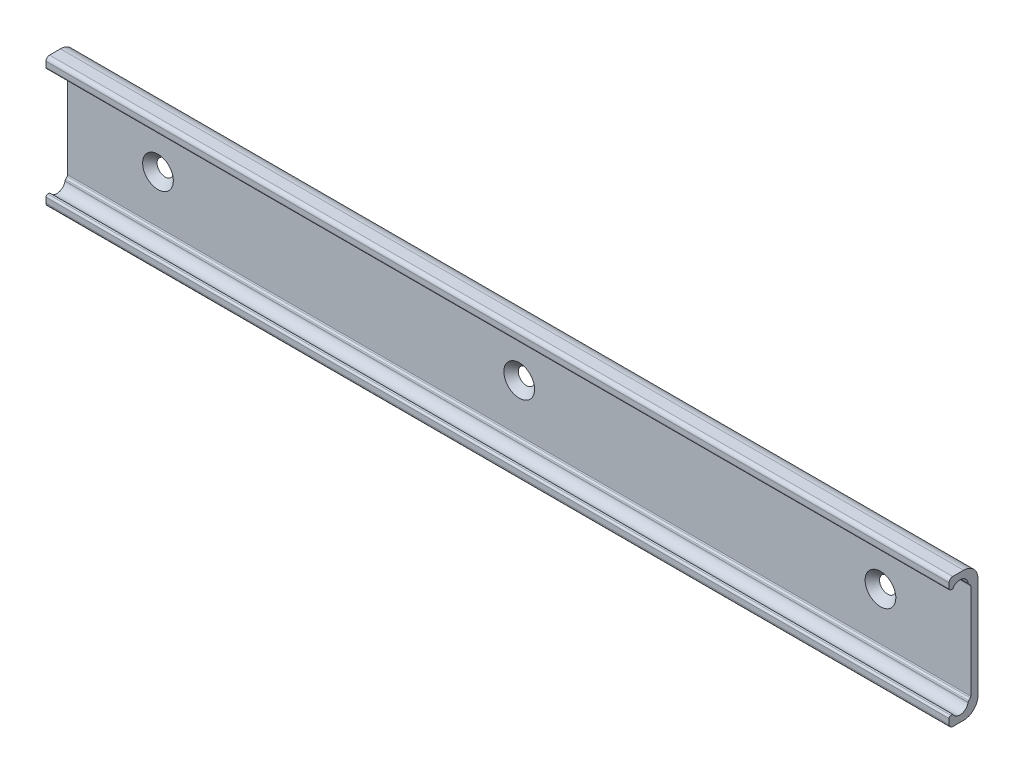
ISO-10303-21;
HEADER;
FILE_DESCRIPTION(('STEP AP214'),'2;1');
FILE_NAME('part.step','',(''),(''),'','','');
FILE_SCHEMA(('AUTOMOTIVE_DESIGN { 1 0 10303 214 1 1 1 1 }'));
ENDSEC;
DATA;
#1=APPLICATION_CONTEXT('core data for automotive mechanical design processes');
#2=APPLICATION_PROTOCOL_DEFINITION('international standard','automotive_design',2000,#1);
#3=PRODUCT_CONTEXT('',#1,'mechanical');
#4=PRODUCT('Part','Part','',(#3));
#5=PRODUCT_RELATED_PRODUCT_CATEGORY('part','',(#4));
#6=PRODUCT_DEFINITION_FORMATION('','',#4);
#7=PRODUCT_DEFINITION_CONTEXT('part definition',#1,'design');
#8=PRODUCT_DEFINITION('design','',#6,#7);
#9=PRODUCT_DEFINITION_SHAPE('','',#8);
#10=(LENGTH_UNIT() NAMED_UNIT(*) SI_UNIT(.MILLI.,.METRE.));
#11=(NAMED_UNIT(*) PLANE_ANGLE_UNIT() SI_UNIT($,.RADIAN.));
#12=(NAMED_UNIT(*) SI_UNIT($,.STERADIAN.) SOLID_ANGLE_UNIT());
#13=UNCERTAINTY_MEASURE_WITH_UNIT(LENGTH_MEASURE(1.E-05),#10,'distance_accuracy_value','');
#14=(GEOMETRIC_REPRESENTATION_CONTEXT(3) GLOBAL_UNCERTAINTY_ASSIGNED_CONTEXT((#13)) GLOBAL_UNIT_ASSIGNED_CONTEXT((#10,
#11,#12)) REPRESENTATION_CONTEXT('',''));
#15=CARTESIAN_POINT('',(0.,0.,0.));
#16=DIRECTION('',(0.,0.,1.));
#17=DIRECTION('',(1.,0.,0.));
#18=AXIS2_PLACEMENT_3D('',#15,#16,#17);
#19=CARTESIAN_POINT('',(225.,14.,4.));
#20=DIRECTION('',(-1.,0.,0.));
#21=DIRECTION('',(0.,0.,1.));
#22=AXIS2_PLACEMENT_3D('',#19,#20,#21);
#23=CYLINDRICAL_SURFACE('',#22,4.);
#24=CARTESIAN_POINT('',(-25.,14.,4.));
#25=DIRECTION('',(-1.,0.,0.));
#26=DIRECTION('',(0.,0.,1.));
#27=AXIS2_PLACEMENT_3D('',#24,#25,#26);
#28=CIRCLE('',#27,4.);
#29=CARTESIAN_POINT('',(-25.,18.,4.));
#30=VERTEX_POINT('',#29);
#31=CARTESIAN_POINT('',(-25.,14.,0.));
#32=VERTEX_POINT('',#31);
#33=EDGE_CURVE('E174',#30,#32,#28,.T.);
#34=ORIENTED_EDGE('',*,*,#33,.F.);
#35=DIRECTION('',(-1.,0.,0.));
#36=VECTOR('',#35,1.);
#37=CARTESIAN_POINT('',(225.,18.,4.));
#38=LINE('',#37,#36);
#39=CARTESIAN_POINT('',(225.,18.,4.));
#40=VERTEX_POINT('',#39);
#41=EDGE_CURVE('E9',#40,#30,#38,.T.);
#42=ORIENTED_EDGE('',*,*,#41,.F.);
#43=CARTESIAN_POINT('',(225.,14.,4.));
#44=DIRECTION('',(-1.,0.,0.));
#45=DIRECTION('',(0.,0.,1.));
#46=AXIS2_PLACEMENT_3D('',#43,#44,#45);
#47=CIRCLE('',#46,4.);
#48=CARTESIAN_POINT('',(225.,14.,0.));
#49=VERTEX_POINT('',#48);
#50=EDGE_CURVE('E176',#40,#49,#47,.T.);
#51=ORIENTED_EDGE('',*,*,#50,.T.);
#52=DIRECTION('',(-1.,0.,0.));
#53=VECTOR('',#52,1.);
#54=CARTESIAN_POINT('',(225.,14.,0.));
#55=LINE('',#54,#53);
#56=EDGE_CURVE('E17',#49,#32,#55,.T.);
#57=ORIENTED_EDGE('',*,*,#56,.T.);
#58=EDGE_LOOP('',(#34,#42,#51,#57));
#59=FACE_BOUND('',#58,.T.);
#60=ADVANCED_FACE('F14',(#59),#23,.T.);
#61=CARTESIAN_POINT('',(225.,18.,7.));
#62=DIRECTION('',(0.,1.,0.));
#63=DIRECTION('',(-1.,0.,0.));
#64=AXIS2_PLACEMENT_3D('',#61,#62,#63);
#65=PLANE('',#64);
#66=DIRECTION('',(0.,0.,-1.));
#67=VECTOR('',#66,1.);
#68=CARTESIAN_POINT('',(-25.,18.,7.));
#69=LINE('',#68,#67);
#70=CARTESIAN_POINT('',(-25.,18.,7.));
#71=VERTEX_POINT('',#70);
#72=EDGE_CURVE('E192',#71,#30,#69,.T.);
#73=ORIENTED_EDGE('',*,*,#72,.F.);
#74=DIRECTION('',(-1.,0.,0.));
#75=VECTOR('',#74,1.);
#76=CARTESIAN_POINT('',(225.,18.,7.));
#77=LINE('',#76,#75);
#78=CARTESIAN_POINT('',(225.,18.,7.));
#79=VERTEX_POINT('',#78);
#80=EDGE_CURVE('E22',#79,#71,#77,.T.);
#81=ORIENTED_EDGE('',*,*,#80,.F.);
#82=DIRECTION('',(0.,0.,-1.));
#83=VECTOR('',#82,1.);
#84=CARTESIAN_POINT('',(225.,18.,7.));
#85=LINE('',#84,#83);
#86=EDGE_CURVE('E181',#79,#40,#85,.T.);
#87=ORIENTED_EDGE('',*,*,#86,.T.);
#88=ORIENTED_EDGE('',*,*,#41,.T.);
#89=EDGE_LOOP('',(#73,#81,#87,#88));
#90=FACE_BOUND('',#89,.T.);
#91=ADVANCED_FACE('F448',(#90),#65,.T.);
#92=CARTESIAN_POINT('',(225.,17.,7.));
#93=DIRECTION('',(-1.,0.,0.));
#94=DIRECTION('',(0.,0.,1.));
#95=AXIS2_PLACEMENT_3D('',#92,#93,#94);
#96=CYLINDRICAL_SURFACE('',#95,1.);
#97=CARTESIAN_POINT('',(-25.,17.,7.));
#98=DIRECTION('',(-1.,0.,0.));
#99=DIRECTION('',(0.,0.,1.));
#100=AXIS2_PLACEMENT_3D('',#97,#98,#99);
#101=CIRCLE('',#100,1.);
#102=CARTESIAN_POINT('',(-25.,17.,8.));
#103=VERTEX_POINT('',#102);
#104=EDGE_CURVE('E258',#103,#71,#101,.T.);
#105=ORIENTED_EDGE('',*,*,#104,.F.);
#106=DIRECTION('',(-1.,0.,0.));
#107=VECTOR('',#106,1.);
#108=CARTESIAN_POINT('',(225.,17.,8.));
#109=LINE('',#108,#107);
#110=CARTESIAN_POINT('',(225.,17.,8.));
#111=VERTEX_POINT('',#110);
#112=EDGE_CURVE('E328',#111,#103,#109,.T.);
#113=ORIENTED_EDGE('',*,*,#112,.F.);
#114=CARTESIAN_POINT('',(225.,17.,7.));
#115=DIRECTION('',(-1.,0.,0.));
#116=DIRECTION('',(0.,0.,1.));
#117=AXIS2_PLACEMENT_3D('',#114,#115,#116);
#118=CIRCLE('',#117,1.);
#119=EDGE_CURVE('E324',#111,#79,#118,.T.);
#120=ORIENTED_EDGE('',*,*,#119,.T.);
#121=ORIENTED_EDGE('',*,*,#80,.T.);
#122=EDGE_LOOP('',(#105,#113,#120,#121));
#123=FACE_BOUND('',#122,.T.);
#124=ADVANCED_FACE('F453',(#123),#96,.T.);
#125=CARTESIAN_POINT('',(225.,15.55,8.));
#126=DIRECTION('',(0.,0.,1.));
#127=DIRECTION('',(1.,0.,0.));
#128=AXIS2_PLACEMENT_3D('',#125,#126,#127);
#129=PLANE('',#128);
#130=DIRECTION('',(0.,1.,0.));
#131=VECTOR('',#130,1.);
#132=CARTESIAN_POINT('',(-25.,15.55,8.));
#133=LINE('',#132,#131);
#134=CARTESIAN_POINT('',(-25.,15.55,8.));
#135=VERTEX_POINT('',#134);
#136=EDGE_CURVE('E255',#135,#103,#133,.T.);
#137=ORIENTED_EDGE('',*,*,#136,.F.);
#138=DIRECTION('',(-1.,0.,0.));
#139=VECTOR('',#138,1.);
#140=CARTESIAN_POINT('',(225.,15.55,8.));
#141=LINE('',#140,#139);
#142=CARTESIAN_POINT('',(225.,15.55,8.));
#143=VERTEX_POINT('',#142);
#144=EDGE_CURVE('E330',#143,#135,#141,.T.);
#145=ORIENTED_EDGE('',*,*,#144,.F.);
#146=DIRECTION('',(0.,1.,0.));
#147=VECTOR('',#146,1.);
#148=CARTESIAN_POINT('',(225.,15.55,8.));
#149=LINE('',#148,#147);
#150=EDGE_CURVE('E321',#143,#111,#149,.T.);
#151=ORIENTED_EDGE('',*,*,#150,.T.);
#152=ORIENTED_EDGE('',*,*,#112,.T.);
#153=EDGE_LOOP('',(#137,#145,#151,#152));
#154=FACE_BOUND('',#153,.T.);
#155=ADVANCED_FACE('F445',(#154),#129,.T.);
#156=CARTESIAN_POINT('',(225.,15.5499998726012,7.5));
#157=DIRECTION('',(-1.,0.,0.));
#158=DIRECTION('',(0.,0.,1.));
#159=AXIS2_PLACEMENT_3D('',#156,#157,#158);
#160=CYLINDRICAL_SURFACE('',#159,0.500000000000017);
#161=CARTESIAN_POINT('',(-25.,15.5499998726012,7.5));
#162=DIRECTION('',(-1.,0.,0.));
#163=DIRECTION('',(0.,0.,1.));
#164=AXIS2_PLACEMENT_3D('',#161,#162,#163);
#165=CIRCLE('',#164,0.500000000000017);
#166=CARTESIAN_POINT('',(-25.,15.0499998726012,7.49999995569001));
#167=VERTEX_POINT('',#166);
#168=EDGE_CURVE('E252',#167,#135,#165,.T.);
#169=ORIENTED_EDGE('',*,*,#168,.F.);
#170=DIRECTION('',(-1.,0.,0.));
#171=VECTOR('',#170,1.);
#172=CARTESIAN_POINT('',(225.,15.0499998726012,7.49999995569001));
#173=LINE('',#172,#171);
#174=CARTESIAN_POINT('',(225.,15.0499998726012,7.49999995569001));
#175=VERTEX_POINT('',#174);
#176=EDGE_CURVE('E332',#175,#167,#173,.T.);
#177=ORIENTED_EDGE('',*,*,#176,.F.);
#178=CARTESIAN_POINT('',(225.,15.5499998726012,7.5));
#179=DIRECTION('',(-1.,0.,0.));
#180=DIRECTION('',(0.,0.,1.));
#181=AXIS2_PLACEMENT_3D('',#178,#179,#180);
#182=CIRCLE('',#181,0.500000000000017);
#183=EDGE_CURVE('E318',#175,#143,#182,.T.);
#184=ORIENTED_EDGE('',*,*,#183,.T.);
#185=ORIENTED_EDGE('',*,*,#144,.T.);
#186=EDGE_LOOP('',(#169,#177,#184,#185));
#187=FACE_BOUND('',#186,.T.);
#188=ADVANCED_FACE('F441',(#187),#160,.T.);
#189=CARTESIAN_POINT('',(225.,15.0499998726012,7.49999995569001));
#190=DIRECTION('',(0.,-1.,0.));
#191=DIRECTION('',(1.,0.,0.));
#192=AXIS2_PLACEMENT_3D('',#189,#190,#191);
#193=PLANE('',#192);
#194=DIRECTION('',(0.,0.,1.));
#195=VECTOR('',#194,1.);
#196=CARTESIAN_POINT('',(-25.,15.0499998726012,7.49999995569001));
#197=LINE('',#196,#195);
#198=CARTESIAN_POINT('',(-25.,15.0499998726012,6.99185845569));
#199=VERTEX_POINT('',#198);
#200=EDGE_CURVE('E249',#199,#167,#197,.T.);
#201=ORIENTED_EDGE('',*,*,#200,.F.);
#202=DIRECTION('',(-1.,0.,0.));
#203=VECTOR('',#202,1.);
#204=CARTESIAN_POINT('',(225.,15.0499998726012,6.99185845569));
#205=LINE('',#204,#203);
#206=CARTESIAN_POINT('',(225.,15.0499998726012,6.99185845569));
#207=VERTEX_POINT('',#206);
#208=EDGE_CURVE('E334',#207,#199,#205,.T.);
#209=ORIENTED_EDGE('',*,*,#208,.F.);
#210=DIRECTION('',(0.,0.,1.));
#211=VECTOR('',#210,1.);
#212=CARTESIAN_POINT('',(225.,15.0499998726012,7.49999995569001));
#213=LINE('',#212,#211);
#214=EDGE_CURVE('E315',#207,#175,#213,.T.);
#215=ORIENTED_EDGE('',*,*,#214,.T.);
#216=ORIENTED_EDGE('',*,*,#176,.T.);
#217=EDGE_LOOP('',(#201,#209,#215,#216));
#218=FACE_BOUND('',#217,.T.);
#219=ADVANCED_FACE('F437',(#218),#193,.T.);
#220=CARTESIAN_POINT('',(225.,13.899999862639,4.99999993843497));
#221=DIRECTION('',(-1.,0.,0.));
#222=DIRECTION('',(0.,0.,1.));
#223=AXIS2_PLACEMENT_3D('',#220,#221,#222);
#224=CYLINDRICAL_SURFACE('',#223,2.30000008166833);
#225=CARTESIAN_POINT('',(-25.,13.899999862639,4.99999993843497));
#226=DIRECTION('',(1.,0.,0.));
#227=DIRECTION('',(0.,0.,1.));
#228=AXIS2_PLACEMENT_3D('',#225,#226,#227);
#229=CIRCLE('',#228,2.30000008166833);
#230=CARTESIAN_POINT('',(-25.,14.3822673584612,2.75112945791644));
#231=VERTEX_POINT('',#230);
#232=EDGE_CURVE('E246',#231,#199,#229,.T.);
#233=ORIENTED_EDGE('',*,*,#232,.F.);
#234=DIRECTION('',(-1.,0.,0.));
#235=VECTOR('',#234,1.);
#236=CARTESIAN_POINT('',(225.,14.3822673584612,2.75112945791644));
#237=LINE('',#236,#235);
#238=CARTESIAN_POINT('',(225.,14.3822673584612,2.75112945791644));
#239=VERTEX_POINT('',#238);
#240=EDGE_CURVE('E336',#239,#231,#237,.T.);
#241=ORIENTED_EDGE('',*,*,#240,.F.);
#242=CARTESIAN_POINT('',(225.,13.899999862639,4.99999993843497));
#243=DIRECTION('',(1.,0.,0.));
#244=DIRECTION('',(0.,0.,1.));
#245=AXIS2_PLACEMENT_3D('',#242,#243,#244);
#246=CIRCLE('',#245,2.30000008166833);
#247=EDGE_CURVE('E312',#239,#207,#246,.T.);
#248=ORIENTED_EDGE('',*,*,#247,.T.);
#249=ORIENTED_EDGE('',*,*,#208,.T.);
#250=EDGE_LOOP('',(#233,#241,#248,#249));
#251=FACE_BOUND('',#250,.T.);
#252=ADVANCED_FACE('F433',(#251),#224,.F.);
#253=CARTESIAN_POINT('',(225.,14.2647621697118,2.72240648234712));
#254=DIRECTION('',(0.,-0.237449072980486,0.971399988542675));
#255=DIRECTION('',(0.,0.971399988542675,0.237449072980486));
#256=AXIS2_PLACEMENT_3D('',#253,#254,#255);
#257=PLANE('',#256);
#258=DIRECTION('',(0.,0.971399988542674,0.237449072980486));
#259=VECTOR('',#258,1.);
#260=CARTESIAN_POINT('',(-25.,14.2647621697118,2.72240648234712));
#261=LINE('',#260,#259);
#262=CARTESIAN_POINT('',(-25.,14.2647621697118,2.72240648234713));
#263=VERTEX_POINT('',#262);
#264=EDGE_CURVE('E243',#263,#231,#261,.T.);
#265=ORIENTED_EDGE('',*,*,#264,.F.);
#266=DIRECTION('',(-1.,0.,0.));
#267=VECTOR('',#266,1.);
#268=CARTESIAN_POINT('',(225.,14.2647621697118,2.72240648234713));
#269=LINE('',#268,#267);
#270=CARTESIAN_POINT('',(225.,14.2647621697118,2.72240648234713));
#271=VERTEX_POINT('',#270);
#272=EDGE_CURVE('E338',#271,#263,#269,.T.);
#273=ORIENTED_EDGE('',*,*,#272,.F.);
#274=DIRECTION('',(0.,0.971399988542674,0.237449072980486));
#275=VECTOR('',#274,1.);
#276=CARTESIAN_POINT('',(225.,14.2647621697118,2.72240648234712));
#277=LINE('',#276,#275);
#278=EDGE_CURVE('E309',#271,#239,#277,.T.);
#279=ORIENTED_EDGE('',*,*,#278,.T.);
#280=ORIENTED_EDGE('',*,*,#240,.T.);
#281=EDGE_LOOP('',(#265,#273,#279,#280));
#282=FACE_BOUND('',#281,.T.);
#283=ADVANCED_FACE('F429',(#282),#257,.T.);
#284=CARTESIAN_POINT('',(225.,14.3343843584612,2.2272774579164));
#285=DIRECTION('',(-1.,0.,0.));
#286=DIRECTION('',(0.,0.,1.));
#287=AXIS2_PLACEMENT_3D('',#284,#285,#286);
#288=CYLINDRICAL_SURFACE('',#287,0.49999999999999);
#289=CARTESIAN_POINT('',(-25.,14.3343843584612,2.2272774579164));
#290=DIRECTION('',(-1.,0.,0.));
#291=DIRECTION('',(0.,0.,1.));
#292=AXIS2_PLACEMENT_3D('',#289,#290,#291);
#293=CIRCLE('',#292,0.49999999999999);
#294=CARTESIAN_POINT('',(-25.,13.980830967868,2.58083084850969));
#295=VERTEX_POINT('',#294);
#296=EDGE_CURVE('E240',#295,#263,#293,.T.);
#297=ORIENTED_EDGE('',*,*,#296,.F.);
#298=DIRECTION('',(-1.,0.,0.));
#299=VECTOR('',#298,1.);
#300=CARTESIAN_POINT('',(225.,13.980830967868,2.58083084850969));
#301=LINE('',#300,#299);
#302=CARTESIAN_POINT('',(225.,13.980830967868,2.58083084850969));
#303=VERTEX_POINT('',#302);
#304=EDGE_CURVE('E340',#303,#295,#301,.T.);
#305=ORIENTED_EDGE('',*,*,#304,.F.);
#306=CARTESIAN_POINT('',(225.,14.3343843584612,2.2272774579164));
#307=DIRECTION('',(-1.,0.,0.));
#308=DIRECTION('',(0.,0.,1.));
#309=AXIS2_PLACEMENT_3D('',#306,#307,#308);
#310=CIRCLE('',#309,0.49999999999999);
#311=EDGE_CURVE('E306',#303,#271,#310,.T.);
#312=ORIENTED_EDGE('',*,*,#311,.T.);
#313=ORIENTED_EDGE('',*,*,#272,.T.);
#314=EDGE_LOOP('',(#297,#305,#312,#313));
#315=FACE_BOUND('',#314,.T.);
#316=ADVANCED_FACE('F425',(#315),#288,.T.);
#317=CARTESIAN_POINT('',(225.,13.5464468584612,2.1464464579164));
#318=DIRECTION('',(0.,-0.707107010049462,0.707106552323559));
#319=DIRECTION('',(0.,0.707106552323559,0.707107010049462));
#320=AXIS2_PLACEMENT_3D('',#317,#318,#319);
#321=PLANE('',#320);
#322=DIRECTION('',(0.,0.707106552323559,0.707107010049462));
#323=VECTOR('',#322,1.);
#324=CARTESIAN_POINT('',(-25.,13.5464468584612,2.1464464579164));
#325=LINE('',#324,#323);
#326=CARTESIAN_POINT('',(-25.,13.5464468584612,2.1464464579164));
#327=VERTEX_POINT('',#326);
#328=EDGE_CURVE('E237',#327,#295,#325,.T.);
#329=ORIENTED_EDGE('',*,*,#328,.F.);
#330=DIRECTION('',(-1.,0.,0.));
#331=VECTOR('',#330,1.);
#332=CARTESIAN_POINT('',(225.,13.5464468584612,2.1464464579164));
#333=LINE('',#332,#331);
#334=CARTESIAN_POINT('',(225.,13.5464468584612,2.1464464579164));
#335=VERTEX_POINT('',#334);
#336=EDGE_CURVE('E342',#335,#327,#333,.T.);
#337=ORIENTED_EDGE('',*,*,#336,.F.);
#338=DIRECTION('',(0.,0.707106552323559,0.707107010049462));
#339=VECTOR('',#338,1.);
#340=CARTESIAN_POINT('',(225.,13.5464468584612,2.1464464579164));
#341=LINE('',#340,#339);
#342=EDGE_CURVE('E303',#335,#303,#341,.T.);
#343=ORIENTED_EDGE('',*,*,#342,.T.);
#344=ORIENTED_EDGE('',*,*,#304,.T.);
#345=EDGE_LOOP('',(#329,#337,#343,#344));
#346=FACE_BOUND('',#345,.T.);
#347=ADVANCED_FACE('F421',(#346),#321,.T.);
#348=CARTESIAN_POINT('',(225.,13.1928934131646,2.49999990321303));
#349=DIRECTION('',(-1.,0.,0.));
#350=DIRECTION('',(0.,0.,1.));
#351=AXIS2_PLACEMENT_3D('',#348,#349,#350);
#352=CYLINDRICAL_SURFACE('',#351,0.500000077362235);
#353=CARTESIAN_POINT('',(-25.,13.1928934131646,2.49999990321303));
#354=DIRECTION('',(1.,0.,0.));
#355=DIRECTION('',(0.,0.,1.));
#356=AXIS2_PLACEMENT_3D('',#353,#354,#355);
#357=CIRCLE('',#356,0.500000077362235);
#358=CARTESIAN_POINT('',(-25.,13.1928934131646,1.9999998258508));
#359=VERTEX_POINT('',#358);
#360=EDGE_CURVE('E234',#359,#327,#357,.T.);
#361=ORIENTED_EDGE('',*,*,#360,.F.);
#362=DIRECTION('',(-1.,0.,0.));
#363=VECTOR('',#362,1.);
#364=CARTESIAN_POINT('',(225.,13.1928934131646,1.9999998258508));
#365=LINE('',#364,#363);
#366=CARTESIAN_POINT('',(225.,13.1928934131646,1.9999998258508));
#367=VERTEX_POINT('',#366);
#368=EDGE_CURVE('E344',#367,#359,#365,.T.);
#369=ORIENTED_EDGE('',*,*,#368,.F.);
#370=CARTESIAN_POINT('',(225.,13.1928934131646,2.49999990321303));
#371=DIRECTION('',(1.,0.,0.));
#372=DIRECTION('',(0.,0.,1.));
#373=AXIS2_PLACEMENT_3D('',#370,#371,#372);
#374=CIRCLE('',#373,0.500000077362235);
#375=EDGE_CURVE('E300',#367,#335,#374,.T.);
#376=ORIENTED_EDGE('',*,*,#375,.T.);
#377=ORIENTED_EDGE('',*,*,#336,.T.);
#378=EDGE_LOOP('',(#361,#369,#376,#377));
#379=FACE_BOUND('',#378,.T.);
#380=ADVANCED_FACE('F417',(#379),#352,.F.);
#381=CARTESIAN_POINT('',(225.,-13.1928934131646,1.9999998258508));
#382=DIRECTION('',(0.,0.,1.));
#383=DIRECTION('',(0.,1.,0.));
#384=AXIS2_PLACEMENT_3D('',#381,#382,#383);
#385=PLANE('',#384);
#386=CARTESIAN_POINT('',(200.,0.,1.9999998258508));
#387=DIRECTION('',(0.,0.,1.));
#388=DIRECTION('',(0.,1.,0.));
#389=AXIS2_PLACEMENT_3D('',#386,#387,#388);
#390=CIRCLE('',#389,4.25);
#391=CARTESIAN_POINT('',(200.,4.25,1.99999982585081));
#392=VERTEX_POINT('',#391);
#393=EDGE_CURVE('E702',#392,#392,#390,.T.);
#394=ORIENTED_EDGE('',*,*,#393,.F.);
#395=EDGE_LOOP('',(#394));
#396=FACE_BOUND('',#395,.T.);
#397=CARTESIAN_POINT('',(100.,0.,1.9999998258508));
#398=DIRECTION('',(0.,0.,1.));
#399=DIRECTION('',(0.,1.,0.));
#400=AXIS2_PLACEMENT_3D('',#397,#398,#399);
#401=CIRCLE('',#400,4.25);
#402=CARTESIAN_POINT('',(100.,4.25,1.99999982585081));
#403=VERTEX_POINT('',#402);
#404=EDGE_CURVE('E706',#403,#403,#401,.T.);
#405=ORIENTED_EDGE('',*,*,#404,.F.);
#406=EDGE_LOOP('',(#405));
#407=FACE_BOUND('',#406,.T.);
#408=CARTESIAN_POINT('',(0.,0.,1.9999998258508));
#409=DIRECTION('',(0.,0.,1.));
#410=DIRECTION('',(0.,1.,0.));
#411=AXIS2_PLACEMENT_3D('',#408,#409,#410);
#412=CIRCLE('',#411,4.25);
#413=CARTESIAN_POINT('',(0.,4.25,1.99999982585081));
#414=VERTEX_POINT('',#413);
#415=EDGE_CURVE('E196',#414,#414,#412,.T.);
#416=ORIENTED_EDGE('',*,*,#415,.F.);
#417=EDGE_LOOP('',(#416));
#418=FACE_BOUND('',#417,.T.);
#419=DIRECTION('',(0.,1.,0.));
#420=VECTOR('',#419,1.);
#421=CARTESIAN_POINT('',(-25.,-13.1928934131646,1.9999998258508));
#422=LINE('',#421,#420);
#423=CARTESIAN_POINT('',(-25.,-13.1928934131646,1.9999998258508));
#424=VERTEX_POINT('',#423);
#425=EDGE_CURVE('E231',#424,#359,#422,.T.);
#426=ORIENTED_EDGE('',*,*,#425,.F.);
#427=DIRECTION('',(-1.,0.,0.));
#428=VECTOR('',#427,1.);
#429=CARTESIAN_POINT('',(225.,-13.1928934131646,1.9999998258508));
#430=LINE('',#429,#428);
#431=CARTESIAN_POINT('',(225.,-13.1928934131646,1.9999998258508));
#432=VERTEX_POINT('',#431);
#433=EDGE_CURVE('E346',#432,#424,#430,.T.);
#434=ORIENTED_EDGE('',*,*,#433,.F.);
#435=DIRECTION('',(0.,1.,0.));
#436=VECTOR('',#435,1.);
#437=CARTESIAN_POINT('',(225.,-13.1928934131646,1.9999998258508));
#438=LINE('',#437,#436);
#439=EDGE_CURVE('E297',#432,#367,#438,.T.);
#440=ORIENTED_EDGE('',*,*,#439,.T.);
#441=ORIENTED_EDGE('',*,*,#368,.T.);
#442=EDGE_LOOP('',(#426,#434,#440,#441));
#443=FACE_BOUND('',#442,.T.);
#444=ADVANCED_FACE('F413',(#396,#407,#418,#443),#385,.T.);
#445=CARTESIAN_POINT('',(225.,-13.1928934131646,2.49999990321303));
#446=DIRECTION('',(-1.,0.,0.));
#447=DIRECTION('',(0.,0.,1.));
#448=AXIS2_PLACEMENT_3D('',#445,#446,#447);
#449=CYLINDRICAL_SURFACE('',#448,0.500000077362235);
#450=CARTESIAN_POINT('',(-25.,-13.1928934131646,2.49999990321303));
#451=DIRECTION('',(1.,0.,0.));
#452=DIRECTION('',(0.,0.,-1.));
#453=AXIS2_PLACEMENT_3D('',#450,#451,#452);
#454=CIRCLE('',#453,0.500000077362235);
#455=CARTESIAN_POINT('',(-25.,-13.5464468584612,2.1464464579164));
#456=VERTEX_POINT('',#455);
#457=EDGE_CURVE('E228',#456,#424,#454,.T.);
#458=ORIENTED_EDGE('',*,*,#457,.F.);
#459=DIRECTION('',(-1.,0.,0.));
#460=VECTOR('',#459,1.);
#461=CARTESIAN_POINT('',(225.,-13.5464468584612,2.1464464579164));
#462=LINE('',#461,#460);
#463=CARTESIAN_POINT('',(225.,-13.5464468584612,2.1464464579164));
#464=VERTEX_POINT('',#463);
#465=EDGE_CURVE('E348',#464,#456,#462,.T.);
#466=ORIENTED_EDGE('',*,*,#465,.F.);
#467=CARTESIAN_POINT('',(225.,-13.1928934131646,2.49999990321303));
#468=DIRECTION('',(1.,0.,0.));
#469=DIRECTION('',(0.,0.,-1.));
#470=AXIS2_PLACEMENT_3D('',#467,#468,#469);
#471=CIRCLE('',#470,0.500000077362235);
#472=EDGE_CURVE('E294',#464,#432,#471,.T.);
#473=ORIENTED_EDGE('',*,*,#472,.T.);
#474=ORIENTED_EDGE('',*,*,#433,.T.);
#475=EDGE_LOOP('',(#458,#466,#473,#474));
#476=FACE_BOUND('',#475,.T.);
#477=ADVANCED_FACE('F409',(#476),#449,.F.);
#478=CARTESIAN_POINT('',(225.,-13.5464468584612,2.1464464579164));
#479=DIRECTION('',(0.,0.707107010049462,0.707106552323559));
#480=DIRECTION('',(0.,0.707106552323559,-0.707107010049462));
#481=AXIS2_PLACEMENT_3D('',#478,#479,#480);
#482=PLANE('',#481);
#483=DIRECTION('',(0.,0.707106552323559,-0.707107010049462));
#484=VECTOR('',#483,1.);
#485=CARTESIAN_POINT('',(-25.,-13.5464468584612,2.1464464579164));
#486=LINE('',#485,#484);
#487=CARTESIAN_POINT('',(-25.,-13.980830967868,2.58083084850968));
#488=VERTEX_POINT('',#487);
#489=EDGE_CURVE('E225',#488,#456,#486,.T.);
#490=ORIENTED_EDGE('',*,*,#489,.F.);
#491=DIRECTION('',(-1.,0.,0.));
#492=VECTOR('',#491,1.);
#493=CARTESIAN_POINT('',(225.,-13.980830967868,2.58083084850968));
#494=LINE('',#493,#492);
#495=CARTESIAN_POINT('',(225.,-13.980830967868,2.58083084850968));
#496=VERTEX_POINT('',#495);
#497=EDGE_CURVE('E350',#496,#488,#494,.T.);
#498=ORIENTED_EDGE('',*,*,#497,.F.);
#499=DIRECTION('',(0.,0.707106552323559,-0.707107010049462));
#500=VECTOR('',#499,1.);
#501=CARTESIAN_POINT('',(225.,-13.5464468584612,2.1464464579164));
#502=LINE('',#501,#500);
#503=EDGE_CURVE('E291',#496,#464,#502,.T.);
#504=ORIENTED_EDGE('',*,*,#503,.T.);
#505=ORIENTED_EDGE('',*,*,#465,.T.);
#506=EDGE_LOOP('',(#490,#498,#504,#505));
#507=FACE_BOUND('',#506,.T.);
#508=ADVANCED_FACE('F405',(#507),#482,.T.);
#509=CARTESIAN_POINT('',(225.,-14.3343843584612,2.22727745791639));
#510=DIRECTION('',(-1.,0.,0.));
#511=DIRECTION('',(0.,0.,1.));
#512=AXIS2_PLACEMENT_3D('',#509,#510,#511);
#513=CYLINDRICAL_SURFACE('',#512,0.49999999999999);
#514=CARTESIAN_POINT('',(-25.,-14.3343843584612,2.22727745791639));
#515=DIRECTION('',(-1.,0.,0.));
#516=DIRECTION('',(0.,0.,-1.));
#517=AXIS2_PLACEMENT_3D('',#514,#515,#516);
#518=CIRCLE('',#517,0.49999999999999);
#519=CARTESIAN_POINT('',(-25.,-14.2647621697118,2.72240648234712));
#520=VERTEX_POINT('',#519);
#521=EDGE_CURVE('E222',#520,#488,#518,.T.);
#522=ORIENTED_EDGE('',*,*,#521,.F.);
#523=DIRECTION('',(-1.,0.,0.));
#524=VECTOR('',#523,1.);
#525=CARTESIAN_POINT('',(225.,-14.2647621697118,2.72240648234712));
#526=LINE('',#525,#524);
#527=CARTESIAN_POINT('',(225.,-14.2647621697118,2.72240648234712));
#528=VERTEX_POINT('',#527);
#529=EDGE_CURVE('E352',#528,#520,#526,.T.);
#530=ORIENTED_EDGE('',*,*,#529,.F.);
#531=CARTESIAN_POINT('',(225.,-14.3343843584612,2.22727745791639));
#532=DIRECTION('',(-1.,0.,0.));
#533=DIRECTION('',(0.,0.,-1.));
#534=AXIS2_PLACEMENT_3D('',#531,#532,#533);
#535=CIRCLE('',#534,0.49999999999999);
#536=EDGE_CURVE('E288',#528,#496,#535,.T.);
#537=ORIENTED_EDGE('',*,*,#536,.T.);
#538=ORIENTED_EDGE('',*,*,#497,.T.);
#539=EDGE_LOOP('',(#522,#530,#537,#538));
#540=FACE_BOUND('',#539,.T.);
#541=ADVANCED_FACE('F401',(#540),#513,.T.);
#542=CARTESIAN_POINT('',(225.,-14.2647621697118,2.72240648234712));
#543=DIRECTION('',(0.,0.237449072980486,0.971399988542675));
#544=DIRECTION('',(0.,0.971399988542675,-0.237449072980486));
#545=AXIS2_PLACEMENT_3D('',#542,#543,#544);
#546=PLANE('',#545);
#547=DIRECTION('',(0.,0.971399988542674,-0.237449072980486));
#548=VECTOR('',#547,1.);
#549=CARTESIAN_POINT('',(-25.,-14.2647621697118,2.72240648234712));
#550=LINE('',#549,#548);
#551=CARTESIAN_POINT('',(-25.,-14.3822673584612,2.75112945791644));
#552=VERTEX_POINT('',#551);
#553=EDGE_CURVE('E219',#552,#520,#550,.T.);
#554=ORIENTED_EDGE('',*,*,#553,.F.);
#555=DIRECTION('',(-1.,0.,0.));
#556=VECTOR('',#555,1.);
#557=CARTESIAN_POINT('',(225.,-14.3822673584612,2.75112945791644));
#558=LINE('',#557,#556);
#559=CARTESIAN_POINT('',(225.,-14.3822673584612,2.75112945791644));
#560=VERTEX_POINT('',#559);
#561=EDGE_CURVE('E354',#560,#552,#558,.T.);
#562=ORIENTED_EDGE('',*,*,#561,.F.);
#563=DIRECTION('',(0.,0.971399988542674,-0.237449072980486));
#564=VECTOR('',#563,1.);
#565=CARTESIAN_POINT('',(225.,-14.2647621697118,2.72240648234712));
#566=LINE('',#565,#564);
#567=EDGE_CURVE('E285',#560,#528,#566,.T.);
#568=ORIENTED_EDGE('',*,*,#567,.T.);
#569=ORIENTED_EDGE('',*,*,#529,.T.);
#570=EDGE_LOOP('',(#554,#562,#568,#569));
#571=FACE_BOUND('',#570,.T.);
#572=ADVANCED_FACE('F397',(#571),#546,.T.);
#573=CARTESIAN_POINT('',(225.,-13.899999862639,4.99999993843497));
#574=DIRECTION('',(-1.,0.,0.));
#575=DIRECTION('',(0.,0.,1.));
#576=AXIS2_PLACEMENT_3D('',#573,#574,#575);
#577=CYLINDRICAL_SURFACE('',#576,2.30000008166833);
#578=CARTESIAN_POINT('',(-25.,-13.899999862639,4.99999993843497));
#579=DIRECTION('',(1.,0.,0.));
#580=DIRECTION('',(0.,0.,-1.));
#581=AXIS2_PLACEMENT_3D('',#578,#579,#580);
#582=CIRCLE('',#581,2.30000008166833);
#583=CARTESIAN_POINT('',(-25.,-15.0499998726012,6.99185845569));
#584=VERTEX_POINT('',#583);
#585=EDGE_CURVE('E216',#584,#552,#582,.T.);
#586=ORIENTED_EDGE('',*,*,#585,.F.);
#587=DIRECTION('',(-1.,0.,0.));
#588=VECTOR('',#587,1.);
#589=CARTESIAN_POINT('',(225.,-15.0499998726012,6.99185845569));
#590=LINE('',#589,#588);
#591=CARTESIAN_POINT('',(225.,-15.0499998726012,6.99185845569));
#592=VERTEX_POINT('',#591);
#593=EDGE_CURVE('E356',#592,#584,#590,.T.);
#594=ORIENTED_EDGE('',*,*,#593,.F.);
#595=CARTESIAN_POINT('',(225.,-13.899999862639,4.99999993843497));
#596=DIRECTION('',(1.,0.,0.));
#597=DIRECTION('',(0.,0.,-1.));
#598=AXIS2_PLACEMENT_3D('',#595,#596,#597);
#599=CIRCLE('',#598,2.30000008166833);
#600=EDGE_CURVE('E282',#592,#560,#599,.T.);
#601=ORIENTED_EDGE('',*,*,#600,.T.);
#602=ORIENTED_EDGE('',*,*,#561,.T.);
#603=EDGE_LOOP('',(#586,#594,#601,#602));
#604=FACE_BOUND('',#603,.T.);
#605=ADVANCED_FACE('F393',(#604),#577,.F.);
#606=CARTESIAN_POINT('',(225.,-15.0499998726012,7.49999995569));
#607=DIRECTION('',(0.,1.,0.));
#608=DIRECTION('',(-1.,0.,0.));
#609=AXIS2_PLACEMENT_3D('',#606,#607,#608);
#610=PLANE('',#609);
#611=DIRECTION('',(0.,0.,-1.));
#612=VECTOR('',#611,1.);
#613=CARTESIAN_POINT('',(-25.,-15.0499998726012,7.49999995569));
#614=LINE('',#613,#612);
#615=CARTESIAN_POINT('',(-25.,-15.0499998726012,7.49999995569));
#616=VERTEX_POINT('',#615);
#617=EDGE_CURVE('E213',#616,#584,#614,.T.);
#618=ORIENTED_EDGE('',*,*,#617,.F.);
#619=DIRECTION('',(-1.,0.,0.));
#620=VECTOR('',#619,1.);
#621=CARTESIAN_POINT('',(225.,-15.0499998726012,7.49999995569));
#622=LINE('',#621,#620);
#623=CARTESIAN_POINT('',(225.,-15.0499998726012,7.49999995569));
#624=VERTEX_POINT('',#623);
#625=EDGE_CURVE('E358',#624,#616,#622,.T.);
#626=ORIENTED_EDGE('',*,*,#625,.F.);
#627=DIRECTION('',(0.,0.,-1.));
#628=VECTOR('',#627,1.);
#629=CARTESIAN_POINT('',(225.,-15.0499998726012,7.49999995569));
#630=LINE('',#629,#628);
#631=EDGE_CURVE('E279',#624,#592,#630,.T.);
#632=ORIENTED_EDGE('',*,*,#631,.T.);
#633=ORIENTED_EDGE('',*,*,#593,.T.);
#634=EDGE_LOOP('',(#618,#626,#632,#633));
#635=FACE_BOUND('',#634,.T.);
#636=ADVANCED_FACE('F389',(#635),#610,.T.);
#637=CARTESIAN_POINT('',(225.,-15.5499998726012,7.5));
#638=DIRECTION('',(-1.,0.,0.));
#639=DIRECTION('',(0.,0.,1.));
#640=AXIS2_PLACEMENT_3D('',#637,#638,#639);
#641=CYLINDRICAL_SURFACE('',#640,0.500000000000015);
#642=CARTESIAN_POINT('',(-25.,-15.5499998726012,7.5));
#643=DIRECTION('',(-1.,0.,0.));
#644=DIRECTION('',(0.,0.,-1.));
#645=AXIS2_PLACEMENT_3D('',#642,#643,#644);
#646=CIRCLE('',#645,0.500000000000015);
#647=CARTESIAN_POINT('',(-25.,-15.55,8.));
#648=VERTEX_POINT('',#647);
#649=EDGE_CURVE('E210',#648,#616,#646,.T.);
#650=ORIENTED_EDGE('',*,*,#649,.F.);
#651=DIRECTION('',(-1.,0.,0.));
#652=VECTOR('',#651,1.);
#653=CARTESIAN_POINT('',(225.,-15.55,8.));
#654=LINE('',#653,#652);
#655=CARTESIAN_POINT('',(225.,-15.55,8.));
#656=VERTEX_POINT('',#655);
#657=EDGE_CURVE('E360',#656,#648,#654,.T.);
#658=ORIENTED_EDGE('',*,*,#657,.F.);
#659=CARTESIAN_POINT('',(225.,-15.5499998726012,7.5));
#660=DIRECTION('',(-1.,0.,0.));
#661=DIRECTION('',(0.,0.,-1.));
#662=AXIS2_PLACEMENT_3D('',#659,#660,#661);
#663=CIRCLE('',#662,0.500000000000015);
#664=EDGE_CURVE('E276',#656,#624,#663,.T.);
#665=ORIENTED_EDGE('',*,*,#664,.T.);
#666=ORIENTED_EDGE('',*,*,#625,.T.);
#667=EDGE_LOOP('',(#650,#658,#665,#666));
#668=FACE_BOUND('',#667,.T.);
#669=ADVANCED_FACE('F385',(#668),#641,.T.);
#670=CARTESIAN_POINT('',(225.,-15.55,8.));
#671=DIRECTION('',(0.,0.,1.));
#672=DIRECTION('',(1.,0.,0.));
#673=AXIS2_PLACEMENT_3D('',#670,#671,#672);
#674=PLANE('',#673);
#675=DIRECTION('',(0.,1.,0.));
#676=VECTOR('',#675,1.);
#677=CARTESIAN_POINT('',(-25.,-15.55,8.));
#678=LINE('',#677,#676);
#679=CARTESIAN_POINT('',(-25.,-17.,8.));
#680=VERTEX_POINT('',#679);
#681=EDGE_CURVE('E207',#680,#648,#678,.T.);
#682=ORIENTED_EDGE('',*,*,#681,.F.);
#683=DIRECTION('',(-1.,0.,0.));
#684=VECTOR('',#683,1.);
#685=CARTESIAN_POINT('',(225.,-17.,8.));
#686=LINE('',#685,#684);
#687=CARTESIAN_POINT('',(225.,-17.,8.));
#688=VERTEX_POINT('',#687);
#689=EDGE_CURVE('E362',#688,#680,#686,.T.);
#690=ORIENTED_EDGE('',*,*,#689,.F.);
#691=DIRECTION('',(0.,1.,0.));
#692=VECTOR('',#691,1.);
#693=CARTESIAN_POINT('',(225.,-15.55,8.));
#694=LINE('',#693,#692);
#695=EDGE_CURVE('E273',#688,#656,#694,.T.);
#696=ORIENTED_EDGE('',*,*,#695,.T.);
#697=ORIENTED_EDGE('',*,*,#657,.T.);
#698=EDGE_LOOP('',(#682,#690,#696,#697));
#699=FACE_BOUND('',#698,.T.);
#700=ADVANCED_FACE('F381',(#699),#674,.T.);
#701=CARTESIAN_POINT('',(225.,-17.,7.));
#702=DIRECTION('',(-1.,0.,0.));
#703=DIRECTION('',(0.,0.,1.));
#704=AXIS2_PLACEMENT_3D('',#701,#702,#703);
#705=CYLINDRICAL_SURFACE('',#704,1.);
#706=CARTESIAN_POINT('',(-25.,-17.,7.));
#707=DIRECTION('',(-1.,0.,0.));
#708=DIRECTION('',(0.,0.,-1.));
#709=AXIS2_PLACEMENT_3D('',#706,#707,#708);
#710=CIRCLE('',#709,1.);
#711=CARTESIAN_POINT('',(-25.,-18.,7.));
#712=VERTEX_POINT('',#711);
#713=EDGE_CURVE('E204',#712,#680,#710,.T.);
#714=ORIENTED_EDGE('',*,*,#713,.F.);
#715=DIRECTION('',(-1.,0.,0.));
#716=VECTOR('',#715,1.);
#717=CARTESIAN_POINT('',(225.,-18.,7.));
#718=LINE('',#717,#716);
#719=CARTESIAN_POINT('',(225.,-18.,7.));
#720=VERTEX_POINT('',#719);
#721=EDGE_CURVE('E364',#720,#712,#718,.T.);
#722=ORIENTED_EDGE('',*,*,#721,.F.);
#723=CARTESIAN_POINT('',(225.,-17.,7.));
#724=DIRECTION('',(-1.,0.,0.));
#725=DIRECTION('',(0.,0.,-1.));
#726=AXIS2_PLACEMENT_3D('',#723,#724,#725);
#727=CIRCLE('',#726,1.);
#728=EDGE_CURVE('E270',#720,#688,#727,.T.);
#729=ORIENTED_EDGE('',*,*,#728,.T.);
#730=ORIENTED_EDGE('',*,*,#689,.T.);
#731=EDGE_LOOP('',(#714,#722,#729,#730));
#732=FACE_BOUND('',#731,.T.);
#733=ADVANCED_FACE('F377',(#732),#705,.T.);
#734=CARTESIAN_POINT('',(225.,-18.,7.));
#735=DIRECTION('',(0.,-1.,0.));
#736=DIRECTION('',(1.,0.,0.));
#737=AXIS2_PLACEMENT_3D('',#734,#735,#736);
#738=PLANE('',#737);
#739=DIRECTION('',(0.,0.,1.));
#740=VECTOR('',#739,1.);
#741=CARTESIAN_POINT('',(-25.,-18.,7.));
#742=LINE('',#741,#740);
#743=CARTESIAN_POINT('',(-25.,-18.,4.));
#744=VERTEX_POINT('',#743);
#745=EDGE_CURVE('E201',#744,#712,#742,.T.);
#746=ORIENTED_EDGE('',*,*,#745,.F.);
#747=DIRECTION('',(-1.,0.,0.));
#748=VECTOR('',#747,1.);
#749=CARTESIAN_POINT('',(225.,-18.,4.));
#750=LINE('',#749,#748);
#751=CARTESIAN_POINT('',(225.,-18.,4.));
#752=VERTEX_POINT('',#751);
#753=EDGE_CURVE('E366',#752,#744,#750,.T.);
#754=ORIENTED_EDGE('',*,*,#753,.F.);
#755=DIRECTION('',(0.,0.,1.));
#756=VECTOR('',#755,1.);
#757=CARTESIAN_POINT('',(225.,-18.,7.));
#758=LINE('',#757,#756);
#759=EDGE_CURVE('E267',#752,#720,#758,.T.);
#760=ORIENTED_EDGE('',*,*,#759,.T.);
#761=ORIENTED_EDGE('',*,*,#721,.T.);
#762=EDGE_LOOP('',(#746,#754,#760,#761));
#763=FACE_BOUND('',#762,.T.);
#764=ADVANCED_FACE('F373',(#763),#738,.T.);
#765=CARTESIAN_POINT('',(225.,-14.,4.));
#766=DIRECTION('',(-1.,0.,0.));
#767=DIRECTION('',(0.,0.,1.));
#768=AXIS2_PLACEMENT_3D('',#765,#766,#767);
#769=CYLINDRICAL_SURFACE('',#768,4.);
#770=CARTESIAN_POINT('',(-25.,-14.,4.));
#771=DIRECTION('',(-1.,0.,0.));
#772=DIRECTION('',(0.,0.,-1.));
#773=AXIS2_PLACEMENT_3D('',#770,#771,#772);
#774=CIRCLE('',#773,4.);
#775=CARTESIAN_POINT('',(-25.,-14.,0.));
#776=VERTEX_POINT('',#775);
#777=EDGE_CURVE('E188',#776,#744,#774,.T.);
#778=ORIENTED_EDGE('',*,*,#777,.F.);
#779=DIRECTION('',(-1.,0.,0.));
#780=VECTOR('',#779,1.);
#781=CARTESIAN_POINT('',(225.,-14.,0.));
#782=LINE('',#781,#780);
#783=CARTESIAN_POINT('',(225.,-14.,0.));
#784=VERTEX_POINT('',#783);
#785=EDGE_CURVE('E180',#784,#776,#782,.T.);
#786=ORIENTED_EDGE('',*,*,#785,.F.);
#787=CARTESIAN_POINT('',(225.,-14.,4.));
#788=DIRECTION('',(-1.,0.,0.));
#789=DIRECTION('',(0.,0.,-1.));
#790=AXIS2_PLACEMENT_3D('',#787,#788,#789);
#791=CIRCLE('',#790,4.);
#792=EDGE_CURVE('E264',#784,#752,#791,.T.);
#793=ORIENTED_EDGE('',*,*,#792,.T.);
#794=ORIENTED_EDGE('',*,*,#753,.T.);
#795=EDGE_LOOP('',(#778,#786,#793,#794));
#796=FACE_BOUND('',#795,.T.);
#797=ADVANCED_FACE('F369',(#796),#769,.T.);
#798=CARTESIAN_POINT('',(225.,-14.,0.));
#799=DIRECTION('',(0.,0.,-1.));
#800=DIRECTION('',(-1.,0.,0.));
#801=AXIS2_PLACEMENT_3D('',#798,#799,#800);
#802=PLANE('',#801);
#803=CARTESIAN_POINT('',(200.,0.,-1.74149182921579E-07));
#804=DIRECTION('',(0.,0.,1.));
#805=DIRECTION('',(0.,1.,0.));
#806=AXIS2_PLACEMENT_3D('',#803,#804,#805);
#807=CIRCLE('',#806,2.25);
#808=CARTESIAN_POINT('',(200.,2.25,-1.74149182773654E-07));
#809=VERTEX_POINT('',#808);
#810=EDGE_CURVE('E705',#809,#809,#807,.T.);
#811=ORIENTED_EDGE('',*,*,#810,.T.);
#812=EDGE_LOOP('',(#811));
#813=FACE_BOUND('',#812,.T.);
#814=CARTESIAN_POINT('',(100.,0.,-1.74149182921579E-07));
#815=DIRECTION('',(0.,0.,1.));
#816=DIRECTION('',(0.,1.,0.));
#817=AXIS2_PLACEMENT_3D('',#814,#815,#816);
#818=CIRCLE('',#817,2.25);
#819=CARTESIAN_POINT('',(100.,2.25,-1.74149182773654E-07));
#820=VERTEX_POINT('',#819);
#821=EDGE_CURVE('E709',#820,#820,#818,.T.);
#822=ORIENTED_EDGE('',*,*,#821,.T.);
#823=EDGE_LOOP('',(#822));
#824=FACE_BOUND('',#823,.T.);
#825=CARTESIAN_POINT('',(0.,0.,-1.74149182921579E-07));
#826=DIRECTION('',(0.,0.,1.));
#827=DIRECTION('',(0.,1.,0.));
#828=AXIS2_PLACEMENT_3D('',#825,#826,#827);
#829=CIRCLE('',#828,2.25);
#830=CARTESIAN_POINT('',(0.,2.25,-1.74149182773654E-07));
#831=VERTEX_POINT('',#830);
#832=EDGE_CURVE('E193',#831,#831,#829,.T.);
#833=ORIENTED_EDGE('',*,*,#832,.T.);
#834=EDGE_LOOP('',(#833));
#835=FACE_BOUND('',#834,.T.);
#836=DIRECTION('',(0.,-1.,0.));
#837=VECTOR('',#836,1.);
#838=CARTESIAN_POINT('',(-25.,-14.,0.));
#839=LINE('',#838,#837);
#840=EDGE_CURVE('E183',#32,#776,#839,.T.);
#841=ORIENTED_EDGE('',*,*,#840,.F.);
#842=ORIENTED_EDGE('',*,*,#56,.F.);
#843=DIRECTION('',(0.,-1.,0.));
#844=VECTOR('',#843,1.);
#845=CARTESIAN_POINT('',(225.,-14.,0.));
#846=LINE('',#845,#844);
#847=EDGE_CURVE('E262',#49,#784,#846,.T.);
#848=ORIENTED_EDGE('',*,*,#847,.T.);
#849=ORIENTED_EDGE('',*,*,#785,.T.);
#850=EDGE_LOOP('',(#841,#842,#848,#849));
#851=FACE_BOUND('',#850,.T.);
#852=ADVANCED_FACE('F184',(#813,#824,#835,#851),#802,.T.);
#853=CARTESIAN_POINT('',(225.,14.,4.));
#854=DIRECTION('',(-1.,0.,0.));
#855=DIRECTION('',(0.,0.,1.));
#856=AXIS2_PLACEMENT_3D('',#853,#854,#855);
#857=PLANE('',#856);
#858=ORIENTED_EDGE('',*,*,#50,.F.);
#859=ORIENTED_EDGE('',*,*,#86,.F.);
#860=ORIENTED_EDGE('',*,*,#119,.F.);
#861=ORIENTED_EDGE('',*,*,#150,.F.);
#862=ORIENTED_EDGE('',*,*,#183,.F.);
#863=ORIENTED_EDGE('',*,*,#214,.F.);
#864=ORIENTED_EDGE('',*,*,#247,.F.);
#865=ORIENTED_EDGE('',*,*,#278,.F.);
#866=ORIENTED_EDGE('',*,*,#311,.F.);
#867=ORIENTED_EDGE('',*,*,#342,.F.);
#868=ORIENTED_EDGE('',*,*,#375,.F.);
#869=ORIENTED_EDGE('',*,*,#439,.F.);
#870=ORIENTED_EDGE('',*,*,#472,.F.);
#871=ORIENTED_EDGE('',*,*,#503,.F.);
#872=ORIENTED_EDGE('',*,*,#536,.F.);
#873=ORIENTED_EDGE('',*,*,#567,.F.);
#874=ORIENTED_EDGE('',*,*,#600,.F.);
#875=ORIENTED_EDGE('',*,*,#631,.F.);
#876=ORIENTED_EDGE('',*,*,#664,.F.);
#877=ORIENTED_EDGE('',*,*,#695,.F.);
#878=ORIENTED_EDGE('',*,*,#728,.F.);
#879=ORIENTED_EDGE('',*,*,#759,.F.);
#880=ORIENTED_EDGE('',*,*,#792,.F.);
#881=ORIENTED_EDGE('',*,*,#847,.F.);
#882=EDGE_LOOP('',(#858,#859,#860,#861,#862,#863,#864,#865,#866,#867,#868,#869,#870,#871,#872,
#873,#874,#875,#876,#877,#878,#879,#880,#881));
#883=FACE_BOUND('',#882,.T.);
#884=ADVANCED_FACE('F452',(#883),#857,.F.);
#885=CARTESIAN_POINT('',(-25.,14.,4.));
#886=DIRECTION('',(-1.,0.,0.));
#887=DIRECTION('',(0.,0.,1.));
#888=AXIS2_PLACEMENT_3D('',#885,#886,#887);
#889=PLANE('',#888);
#890=ORIENTED_EDGE('',*,*,#33,.T.);
#891=ORIENTED_EDGE('',*,*,#840,.T.);
#892=ORIENTED_EDGE('',*,*,#777,.T.);
#893=ORIENTED_EDGE('',*,*,#745,.T.);
#894=ORIENTED_EDGE('',*,*,#713,.T.);
#895=ORIENTED_EDGE('',*,*,#681,.T.);
#896=ORIENTED_EDGE('',*,*,#649,.T.);
#897=ORIENTED_EDGE('',*,*,#617,.T.);
#898=ORIENTED_EDGE('',*,*,#585,.T.);
#899=ORIENTED_EDGE('',*,*,#553,.T.);
#900=ORIENTED_EDGE('',*,*,#521,.T.);
#901=ORIENTED_EDGE('',*,*,#489,.T.);
#902=ORIENTED_EDGE('',*,*,#457,.T.);
#903=ORIENTED_EDGE('',*,*,#425,.T.);
#904=ORIENTED_EDGE('',*,*,#360,.T.);
#905=ORIENTED_EDGE('',*,*,#328,.T.);
#906=ORIENTED_EDGE('',*,*,#296,.T.);
#907=ORIENTED_EDGE('',*,*,#264,.T.);
#908=ORIENTED_EDGE('',*,*,#232,.T.);
#909=ORIENTED_EDGE('',*,*,#200,.T.);
#910=ORIENTED_EDGE('',*,*,#168,.T.);
#911=ORIENTED_EDGE('',*,*,#136,.T.);
#912=ORIENTED_EDGE('',*,*,#104,.T.);
#913=ORIENTED_EDGE('',*,*,#72,.T.);
#914=EDGE_LOOP('',(#890,#891,#892,#893,#894,#895,#896,#897,#898,#899,#900,#901,#902,#903,#904,
#905,#906,#907,#908,#909,#910,#911,#912,#913));
#915=FACE_BOUND('',#914,.T.);
#916=ADVANCED_FACE('F190',(#915),#889,.T.);
#917=CARTESIAN_POINT('',(0.,0.,1.9999998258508));
#918=DIRECTION('',(0.,0.,1.));
#919=DIRECTION('',(0.,1.,0.));
#920=AXIS2_PLACEMENT_3D('',#917,#918,#919);
#921=CONICAL_SURFACE('',#920,4.25,0.78539816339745);
#922=ORIENTED_EDGE('',*,*,#415,.T.);
#923=EDGE_LOOP('',(#922));
#924=FACE_BOUND('',#923,.T.);
#925=ORIENTED_EDGE('',*,*,#832,.F.);
#926=EDGE_LOOP('',(#925));
#927=FACE_BOUND('',#926,.T.);
#928=ADVANCED_FACE('F645',(#924,#927),#921,.F.);
#929=CARTESIAN_POINT('',(100.,0.,1.9999998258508));
#930=DIRECTION('',(0.,0.,1.));
#931=DIRECTION('',(0.,1.,0.));
#932=AXIS2_PLACEMENT_3D('',#929,#930,#931);
#933=CONICAL_SURFACE('',#932,4.25,0.78539816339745);
#934=ORIENTED_EDGE('',*,*,#404,.T.);
#935=EDGE_LOOP('',(#934));
#936=FACE_BOUND('',#935,.T.);
#937=ORIENTED_EDGE('',*,*,#821,.F.);
#938=EDGE_LOOP('',(#937));
#939=FACE_BOUND('',#938,.T.);
#940=ADVANCED_FACE('F653',(#936,#939),#933,.F.);
#941=CARTESIAN_POINT('',(200.,0.,1.9999998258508));
#942=DIRECTION('',(0.,0.,1.));
#943=DIRECTION('',(0.,1.,0.));
#944=AXIS2_PLACEMENT_3D('',#941,#942,#943);
#945=CONICAL_SURFACE('',#944,4.25,0.78539816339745);
#946=ORIENTED_EDGE('',*,*,#393,.T.);
#947=EDGE_LOOP('',(#946));
#948=FACE_BOUND('',#947,.T.);
#949=ORIENTED_EDGE('',*,*,#810,.F.);
#950=EDGE_LOOP('',(#949));
#951=FACE_BOUND('',#950,.T.);
#952=ADVANCED_FACE('F662',(#948,#951),#945,.F.);
#953=CLOSED_SHELL('',(#60,#91,#124,#155,#188,#219,#252,#283,#316,#347,#380,#444,#477,#508,#541,
#572,#605,#636,#669,#700,#733,#764,#797,#852,#884,#916,#928,#940,#952));
#954=MANIFOLD_SOLID_BREP('B1',#953);
#955=ADVANCED_BREP_SHAPE_REPRESENTATION('',(#18,#954),#14);
#956=SHAPE_DEFINITION_REPRESENTATION(#9,#955);
ENDSEC;
END-ISO-10303-21;
